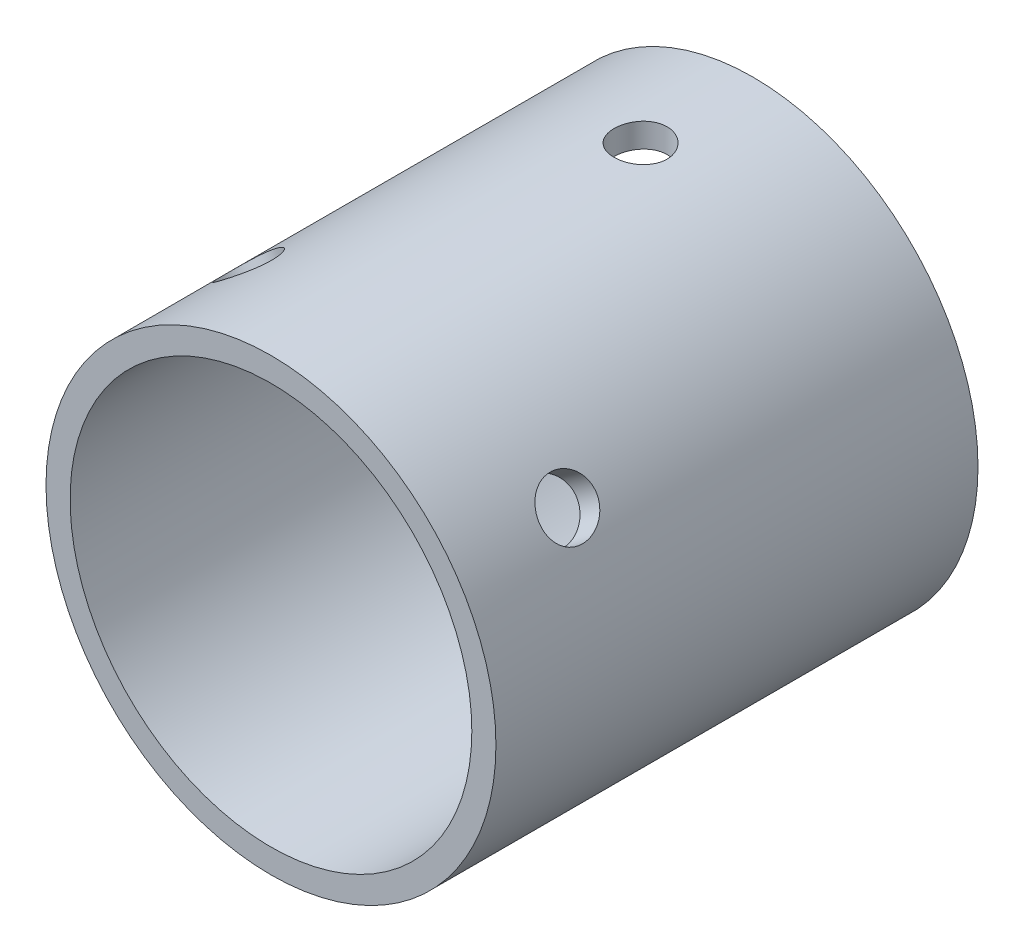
ISO-10303-21;
HEADER;
FILE_DESCRIPTION(('STEP AP214'),'2;1');
FILE_NAME('part.step','',(''),(''),'','','');
FILE_SCHEMA(('AUTOMOTIVE_DESIGN { 1 0 10303 214 1 1 1 1 }'));
ENDSEC;
DATA;
#1=APPLICATION_CONTEXT('core data for automotive mechanical design processes');
#2=APPLICATION_PROTOCOL_DEFINITION('international standard','automotive_design',2000,#1);
#3=PRODUCT_CONTEXT('',#1,'mechanical');
#4=PRODUCT('Part','Part','',(#3));
#5=PRODUCT_RELATED_PRODUCT_CATEGORY('part','',(#4));
#6=PRODUCT_DEFINITION_FORMATION('','',#4);
#7=PRODUCT_DEFINITION_CONTEXT('part definition',#1,'design');
#8=PRODUCT_DEFINITION('design','',#6,#7);
#9=PRODUCT_DEFINITION_SHAPE('','',#8);
#10=(LENGTH_UNIT() NAMED_UNIT(*) SI_UNIT(.MILLI.,.METRE.));
#11=(NAMED_UNIT(*) PLANE_ANGLE_UNIT() SI_UNIT($,.RADIAN.));
#12=(NAMED_UNIT(*) SI_UNIT($,.STERADIAN.) SOLID_ANGLE_UNIT());
#13=UNCERTAINTY_MEASURE_WITH_UNIT(LENGTH_MEASURE(1.E-05),#10,'distance_accuracy_value','');
#14=(GEOMETRIC_REPRESENTATION_CONTEXT(3) GLOBAL_UNCERTAINTY_ASSIGNED_CONTEXT((#13)) GLOBAL_UNIT_ASSIGNED_CONTEXT((#10,
#11,#12)) REPRESENTATION_CONTEXT('',''));
#15=CARTESIAN_POINT('',(0.,0.,0.));
#16=DIRECTION('',(0.,0.,1.));
#17=DIRECTION('',(1.,0.,0.));
#18=AXIS2_PLACEMENT_3D('',#15,#16,#17);
#19=CARTESIAN_POINT('',(0.,0.,30.));
#20=DIRECTION('',(0.,0.,-1.));
#21=DIRECTION('',(-1.,0.,0.));
#22=AXIS2_PLACEMENT_3D('',#19,#20,#21);
#23=CYLINDRICAL_SURFACE('',#22,14.);
#24=CARTESIAN_POINT('',(0.,0.,0.));
#25=DIRECTION('',(0.,0.,1.));
#26=DIRECTION('',(1.,0.,0.));
#27=AXIS2_PLACEMENT_3D('',#24,#25,#26);
#28=CIRCLE('',#27,14.);
#29=CARTESIAN_POINT('',(14.,0.,0.));
#30=VERTEX_POINT('',#29);
#31=EDGE_CURVE('E46',#30,#30,#28,.T.);
#32=ORIENTED_EDGE('',*,*,#31,.T.);
#33=EDGE_LOOP('',(#32));
#34=FACE_BOUND('',#33,.T.);
#35=CARTESIAN_POINT('',(0.,0.,30.));
#36=DIRECTION('',(0.,0.,1.));
#37=DIRECTION('',(1.,0.,0.));
#38=AXIS2_PLACEMENT_3D('',#35,#36,#37);
#39=CIRCLE('',#38,14.);
#40=CARTESIAN_POINT('',(14.,0.,30.));
#41=VERTEX_POINT('',#40);
#42=EDGE_CURVE('E10',#41,#41,#39,.T.);
#43=ORIENTED_EDGE('',*,*,#42,.F.);
#44=EDGE_LOOP('',(#43));
#45=FACE_BOUND('',#44,.T.);
#46=CARTESIAN_POINT('',(0.,14.,5.35));
#47=CARTESIAN_POINT('',(-0.0923377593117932,13.9999987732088,5.35000394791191));
#48=CARTESIAN_POINT('',(-0.184734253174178,13.9990768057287,5.35777727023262));
#49=CARTESIAN_POINT('',(-0.366959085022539,13.9954875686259,5.38866552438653));
#50=CARTESIAN_POINT('',(-0.456784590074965,13.9928184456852,5.41179674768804));
#51=CARTESIAN_POINT('',(-0.631202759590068,13.9860357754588,5.47271235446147));
#52=CARTESIAN_POINT('',(-0.715798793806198,13.9819231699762,5.51048718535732));
#53=CARTESIAN_POINT('',(-0.877433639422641,13.9727116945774,5.59959751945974));
#54=CARTESIAN_POINT('',(-0.954473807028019,13.9676130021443,5.6509305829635));
#55=CARTESIAN_POINT('',(-1.09920581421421,13.9569711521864,5.76597046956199));
#56=CARTESIAN_POINT('',(-1.16685515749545,13.9514261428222,5.82973059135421));
#57=CARTESIAN_POINT('',(-1.29051941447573,13.9405316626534,5.9677004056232));
#58=CARTESIAN_POINT('',(-1.34653375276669,13.9351822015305,6.04191061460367));
#59=CARTESIAN_POINT('',(-1.44549410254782,13.9252661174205,6.19894739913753));
#60=CARTESIAN_POINT('',(-1.48840067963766,13.9207018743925,6.28179898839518));
#61=CARTESIAN_POINT('',(-1.55967573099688,13.9128970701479,6.45359427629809));
#62=CARTESIAN_POINT('',(-1.58804469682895,13.9096564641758,6.54253776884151));
#63=CARTESIAN_POINT('',(-1.62931096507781,13.9048833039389,6.72355301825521));
#64=CARTESIAN_POINT('',(-1.64227968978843,13.9033428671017,6.81560828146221));
#65=CARTESIAN_POINT('',(-1.65259827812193,13.902120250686,7.00060059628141));
#66=CARTESIAN_POINT('',(-1.64994870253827,13.9024380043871,7.09353761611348));
#67=CARTESIAN_POINT('',(-1.62916460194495,13.9048886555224,7.27715922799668));
#68=CARTESIAN_POINT('',(-1.61110853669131,13.9070123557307,7.36785284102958));
#69=CARTESIAN_POINT('',(-1.56014631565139,13.9128212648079,7.54491364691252));
#70=CARTESIAN_POINT('',(-1.52723988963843,13.9165065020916,7.63128076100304));
#71=CARTESIAN_POINT('',(-1.44742600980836,13.9250337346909,7.79748193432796));
#72=CARTESIAN_POINT('',(-1.40048424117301,13.9298785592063,7.87729936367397));
#73=CARTESIAN_POINT('',(-1.293956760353,13.9401768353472,8.02795329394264));
#74=CARTESIAN_POINT('',(-1.23437053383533,13.9456303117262,8.09878942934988));
#75=CARTESIAN_POINT('',(-1.10380969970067,13.9565723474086,8.22992556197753));
#76=CARTESIAN_POINT('',(-1.0327674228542,13.9620609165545,8.29015820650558));
#77=CARTESIAN_POINT('',(-0.881544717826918,13.9724233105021,8.39785388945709));
#78=CARTESIAN_POINT('',(-0.801364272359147,13.9772971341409,8.44531690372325));
#79=CARTESIAN_POINT('',(-0.634090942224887,13.9858834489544,8.52612522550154));
#80=CARTESIAN_POINT('',(-0.546996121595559,13.989595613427,8.55946656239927));
#81=CARTESIAN_POINT('',(-0.368390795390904,13.995437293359,8.61103289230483));
#82=CARTESIAN_POINT('',(-0.276880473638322,13.9975668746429,8.62925851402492));
#83=CARTESIAN_POINT('',(-0.0926244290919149,13.9999949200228,8.64998933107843));
#84=CARTESIAN_POINT('',(0.000110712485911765,14.0003041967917,8.65258735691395));
#85=CARTESIAN_POINT('',(0.184695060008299,13.9990859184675,8.6422338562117));
#86=CARTESIAN_POINT('',(0.276544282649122,13.9975583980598,8.62928262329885));
#87=CARTESIAN_POINT('',(0.45647745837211,13.9928449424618,8.58827533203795));
#88=CARTESIAN_POINT('',(0.544571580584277,13.9896638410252,8.56026329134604));
#89=CARTESIAN_POINT('',(0.714811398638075,13.9819995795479,8.48997514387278));
#90=CARTESIAN_POINT('',(0.79695691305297,13.9775163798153,8.44769860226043));
#91=CARTESIAN_POINT('',(0.953383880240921,13.9677212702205,8.34985520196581));
#92=CARTESIAN_POINT('',(1.02762735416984,13.962405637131,8.29422800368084));
#93=CARTESIAN_POINT('',(1.16575694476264,13.9515526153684,8.17134805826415));
#94=CARTESIAN_POINT('',(1.22964269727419,13.9460152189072,8.10409490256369));
#95=CARTESIAN_POINT('',(1.3455705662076,13.935309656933,7.95946436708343));
#96=CARTESIAN_POINT('',(1.39755133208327,13.9301434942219,7.88203764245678));
#97=CARTESIAN_POINT('',(1.48777049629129,13.9207975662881,7.71949847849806));
#98=CARTESIAN_POINT('',(1.52600914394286,13.9166177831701,7.63438617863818));
#99=CARTESIAN_POINT('',(1.58755824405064,13.909731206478,7.45909366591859));
#100=CARTESIAN_POINT('',(1.61090387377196,13.9070209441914,7.36892594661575));
#101=CARTESIAN_POINT('',(1.64211780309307,13.9033700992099,7.18591634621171));
#102=CARTESIAN_POINT('',(1.64998673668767,13.9024294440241,7.09307457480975));
#103=CARTESIAN_POINT('',(1.6500131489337,13.9024262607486,6.90796245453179));
#104=CARTESIAN_POINT('',(1.64226700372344,13.9033522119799,6.81569210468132));
#105=CARTESIAN_POINT('',(1.61148661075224,13.9069532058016,6.63377413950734));
#106=CARTESIAN_POINT('',(1.58845235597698,13.9096282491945,6.54412652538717));
#107=CARTESIAN_POINT('',(1.52777867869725,13.9164225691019,6.37000785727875));
#108=CARTESIAN_POINT('',(1.49014335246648,13.9205414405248,6.28553535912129));
#109=CARTESIAN_POINT('',(1.4013454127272,13.9297600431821,6.12408961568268));
#110=CARTESIAN_POINT('',(1.35018270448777,13.9348597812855,6.04711642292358));
#111=CARTESIAN_POINT('',(1.23542317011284,13.9455032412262,5.90236106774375));
#112=CARTESIAN_POINT('',(1.17175446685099,13.9510494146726,5.83463606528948));
#113=CARTESIAN_POINT('',(1.03393869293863,13.9619389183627,5.71079316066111));
#114=CARTESIAN_POINT('',(0.959789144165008,13.9672822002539,5.6546780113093));
#115=CARTESIAN_POINT('',(0.8028308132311,13.9771836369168,5.55548848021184));
#116=CARTESIAN_POINT('',(0.719993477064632,13.9817390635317,5.51245903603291));
#117=CARTESIAN_POINT('',(0.548263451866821,13.9895234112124,5.44098152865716));
#118=CARTESIAN_POINT('',(0.459377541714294,13.9927537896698,5.41251743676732));
#119=CARTESIAN_POINT('',(0.30834826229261,13.9967351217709,5.37788015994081));
#120=CARTESIAN_POINT('',(0.247161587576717,13.9979535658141,5.36743989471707));
#121=CARTESIAN_POINT('',(0.123992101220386,13.999586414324,5.35349851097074));
#122=CARTESIAN_POINT('',(0.0620092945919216,14.0000008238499,5.34999734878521));
#123=CARTESIAN_POINT('',(0.,14.,5.35));
#124=B_SPLINE_CURVE_WITH_KNOTS('',3,(#46,#47,#48,#49,#50,#51,#52,#53,#54,#55,#56,#57,#58,#59,
#60,#61,#62,#63,#64,#65,#66,#67,#68,#69,#70,#71,#72,#73,#74,#75,#76,#77,#78,#79,#80,#81,#82,#83,
#84,#85,#86,#87,#88,#89,#90,#91,#92,#93,#94,#95,#96,#97,#98,#99,#100,#101,#102,#103,#104,#105,
#106,#107,#108,#109,#110,#111,#112,#113,#114,#115,#116,#117,#118,#119,#120,#121,#122,#123),
.UNSPECIFIED.,.T.,.F.,(4,2,2,2,2,2,2,2,2,2,2,2,2,2,2,2,2,2,2,2,2,2,2,2,2,2,2,2,2,2,2,2,2,2,2,2,
2,2,4),(0.,0.276786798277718,0.55386767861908,0.830768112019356,1.10761875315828,
1.38568400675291,1.66376300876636,1.94267054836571,2.22156865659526,2.49916819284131,
2.77675776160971,3.05294204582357,3.32913135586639,3.60600151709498,3.88288294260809,
4.16146418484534,4.44004595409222,4.71870600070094,4.99735445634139,5.2743460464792,
5.55133240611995,5.82751359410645,6.10370320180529,6.38116539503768,6.65863734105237,
6.93750854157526,7.21637468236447,7.4945796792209,7.77277327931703,8.04925512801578,
8.32573710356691,8.60214156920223,8.87854797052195,9.15659210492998,9.43470209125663,
9.71375662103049,9.99250339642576,10.1783803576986,10.3642561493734),.UNSPECIFIED.);
#125=CARTESIAN_POINT('',(0.,14.,5.35));
#126=VERTEX_POINT('',#125);
#127=EDGE_CURVE('E62',#126,#126,#124,.T.);
#128=ORIENTED_EDGE('',*,*,#127,.F.);
#129=EDGE_LOOP('',(#128));
#130=FACE_BOUND('',#129,.T.);
#131=CARTESIAN_POINT('',(12.3819398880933,6.5335721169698,23.));
#132=CARTESIAN_POINT('',(12.3819386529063,6.53357633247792,22.9021146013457));
#133=CARTESIAN_POINT('',(12.3780700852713,6.54092220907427,22.8041680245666));
#134=CARTESIAN_POINT('',(12.3626278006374,6.57006052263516,22.6110007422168));
#135=CARTESIAN_POINT('',(12.3510460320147,6.59186805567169,22.5157829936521));
#136=CARTESIAN_POINT('',(12.3203136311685,6.64912935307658,22.3308980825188));
#137=CARTESIAN_POINT('',(12.301168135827,6.68457385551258,22.2412272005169));
#138=CARTESIAN_POINT('',(12.2555427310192,6.76785906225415,22.0698900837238));
#139=CARTESIAN_POINT('',(12.2290640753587,6.8156976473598,21.9882224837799));
#140=CARTESIAN_POINT('',(12.1689695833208,6.9224228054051,21.8347364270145));
#141=CARTESIAN_POINT('',(12.1353187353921,6.9813634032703,21.7629692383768));
#142=CARTESIAN_POINT('',(12.0614665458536,7.10819237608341,21.6317640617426));
#143=CARTESIAN_POINT('',(12.0212648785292,7.17608119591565,21.5723266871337));
#144=CARTESIAN_POINT('',(11.9348719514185,7.31886648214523,21.4672844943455));
#145=CARTESIAN_POINT('',(11.8886613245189,7.39378537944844,21.4217260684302));
#146=CARTESIAN_POINT('',(11.7913045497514,7.54807582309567,21.3460321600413));
#147=CARTESIAN_POINT('',(11.7401585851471,7.62744720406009,21.3158961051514));
#148=CARTESIAN_POINT('',(11.6344198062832,7.78777531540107,21.2720555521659));
#149=CARTESIAN_POINT('',(11.5798464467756,7.86872156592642,21.2582658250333));
#150=CARTESIAN_POINT('',(11.4684594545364,8.03019648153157,21.2472452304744));
#151=CARTESIAN_POINT('',(11.411645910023,8.11072516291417,21.2500137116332));
#152=CARTESIAN_POINT('',(11.2977545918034,8.26862552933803,21.2719626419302));
#153=CARTESIAN_POINT('',(11.2406800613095,8.34601232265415,21.291051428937));
#154=CARTESIAN_POINT('',(11.1277247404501,8.49603228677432,21.344955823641));
#155=CARTESIAN_POINT('',(11.0718439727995,8.56866536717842,21.3797717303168));
#156=CARTESIAN_POINT('',(10.9629667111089,8.70753555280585,21.4642395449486));
#157=CARTESIAN_POINT('',(10.909978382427,8.77375492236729,21.5139311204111));
#158=CARTESIAN_POINT('',(10.8088812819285,8.89800602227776,21.6267108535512));
#159=CARTESIAN_POINT('',(10.7607727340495,8.95603737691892,21.689799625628));
#160=CARTESIAN_POINT('',(10.6708704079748,9.06297126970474,21.8280962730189));
#161=CARTESIAN_POINT('',(10.6291220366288,9.11180870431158,21.9033840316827));
#162=CARTESIAN_POINT('',(10.5539401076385,9.19878599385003,22.0636670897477));
#163=CARTESIAN_POINT('',(10.5205065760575,9.23692581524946,22.1486624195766));
#164=CARTESIAN_POINT('',(10.4632838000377,9.30169715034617,22.3260186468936));
#165=CARTESIAN_POINT('',(10.439498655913,9.32832377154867,22.4183826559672));
#166=CARTESIAN_POINT('',(10.402589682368,9.36946630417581,22.6078176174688));
#167=CARTESIAN_POINT('',(10.3894653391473,9.3839827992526,22.7048883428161));
#168=CARTESIAN_POINT('',(10.3744921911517,9.40053390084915,22.9002802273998));
#169=CARTESIAN_POINT('',(10.3725679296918,9.40265203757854,22.9985885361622));
#170=CARTESIAN_POINT('',(10.3798755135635,9.3945842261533,23.1942793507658));
#171=CARTESIAN_POINT('',(10.3891071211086,9.38439854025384,23.2916618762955));
#172=CARTESIAN_POINT('',(10.4182813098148,9.35199883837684,23.4824020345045));
#173=CARTESIAN_POINT('',(10.4381876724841,9.32982549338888,23.5757721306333));
#174=CARTESIAN_POINT('',(10.487862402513,9.27394907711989,23.7562269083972));
#175=CARTESIAN_POINT('',(10.5176311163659,9.24024560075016,23.8433113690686));
#176=CARTESIAN_POINT('',(10.5860213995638,9.16181543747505,24.0092282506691));
#177=CARTESIAN_POINT('',(10.6246888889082,9.11703147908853,24.0880146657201));
#178=CARTESIAN_POINT('',(10.7092940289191,9.01749837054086,24.2346295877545));
#179=CARTESIAN_POINT('',(10.7552319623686,8.96274883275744,24.3024576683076));
#180=CARTESIAN_POINT('',(10.8529588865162,8.84416241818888,24.4256229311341));
#181=CARTESIAN_POINT('',(10.9047797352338,8.7802755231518,24.4808867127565));
#182=CARTESIAN_POINT('',(11.0122036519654,8.64516103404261,24.5768467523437));
#183=CARTESIAN_POINT('',(11.0678066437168,8.57393358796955,24.6175433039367));
#184=CARTESIAN_POINT('',(11.1807431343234,8.42612620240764,24.6830924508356));
#185=CARTESIAN_POINT('',(11.2380715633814,8.34956121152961,24.7079874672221));
#186=CARTESIAN_POINT('',(11.3527512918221,8.19295137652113,24.7413648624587));
#187=CARTESIAN_POINT('',(11.4101025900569,8.11290668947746,24.7498479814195));
#188=CARTESIAN_POINT('',(11.5227149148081,7.95214487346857,24.7501469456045));
#189=CARTESIAN_POINT('',(11.5779875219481,7.87143604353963,24.7420759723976));
#190=CARTESIAN_POINT('',(11.6853488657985,7.71115617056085,24.7097355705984));
#191=CARTESIAN_POINT('',(11.7374376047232,7.63158512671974,24.6854661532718));
#192=CARTESIAN_POINT('',(11.8371472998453,7.47599398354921,24.6214533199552));
#193=CARTESIAN_POINT('',(11.8847698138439,7.39997265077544,24.5817153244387));
#194=CARTESIAN_POINT('',(11.9745580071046,7.25378031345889,24.4879050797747));
#195=CARTESIAN_POINT('',(12.0167236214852,7.18360937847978,24.4338326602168));
#196=CARTESIAN_POINT('',(12.095083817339,7.05088191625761,24.3124697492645));
#197=CARTESIAN_POINT('',(12.1312375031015,6.98837824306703,24.2450950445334));
#198=CARTESIAN_POINT('',(12.1966673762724,6.87354962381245,24.0992149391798));
#199=CARTESIAN_POINT('',(12.2259419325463,6.82122709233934,24.0207069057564));
#200=CARTESIAN_POINT('',(12.2772942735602,6.72836388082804,23.8544410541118));
#201=CARTESIAN_POINT('',(12.2993438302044,6.68786947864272,23.7666486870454));
#202=CARTESIAN_POINT('',(12.3357947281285,6.62039668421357,23.5846002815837));
#203=CARTESIAN_POINT('',(12.3502043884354,6.59340359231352,23.4903514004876));
#204=CARTESIAN_POINT('',(12.3677826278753,6.56034810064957,23.3296790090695));
#205=CARTESIAN_POINT('',(12.3730880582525,6.55032441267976,23.2642689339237));
#206=CARTESIAN_POINT('',(12.3801670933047,6.53693501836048,23.1325819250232));
#207=CARTESIAN_POINT('',(12.3819407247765,6.53356926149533,23.0663049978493));
#208=CARTESIAN_POINT('',(12.3819398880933,6.5335721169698,23.));
#209=B_SPLINE_CURVE_WITH_KNOTS('',3,(#131,#132,#133,#134,#135,#136,#137,#138,#139,#140,#141,
#142,#143,#144,#145,#146,#147,#148,#149,#150,#151,#152,#153,#154,#155,#156,#157,#158,#159,#160,
#161,#162,#163,#164,#165,#166,#167,#168,#169,#170,#171,#172,#173,#174,#175,#176,#177,#178,#179,
#180,#181,#182,#183,#184,#185,#186,#187,#188,#189,#190,#191,#192,#193,#194,#195,#196,#197,#198,
#199,#200,#201,#202,#203,#204,#205,#206,#207,#208),.UNSPECIFIED.,.T.,.F.,(4,2,2,2,2,2,2,2,2,2,2,
2,2,2,2,2,2,2,2,2,2,2,2,2,2,2,2,2,2,2,2,2,2,2,2,2,2,2,4),(0.,0.293413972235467,
0.587134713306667,0.880656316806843,1.17412776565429,1.46906604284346,1.76401898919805,
2.05994730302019,2.35586463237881,2.6502321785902,2.94458814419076,3.23730165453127,
3.53002072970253,3.82352743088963,4.11704759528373,4.41257388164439,4.70810109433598,
5.00375376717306,5.29939219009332,5.59303652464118,5.88667460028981,6.17932263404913,
6.47198095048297,6.76618473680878,7.06039996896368,7.3562922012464,7.65217846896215,
7.94726699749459,8.24234221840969,8.53540671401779,8.82847100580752,9.12143269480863,
9.41439786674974,9.70928090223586,10.0042337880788,10.3003256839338,10.5960945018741,
10.7948469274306,10.9935978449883),.UNSPECIFIED.);
#210=CARTESIAN_POINT('',(12.3819398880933,6.5335721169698,23.));
#211=VERTEX_POINT('',#210);
#212=EDGE_CURVE('E63',#211,#211,#209,.T.);
#213=ORIENTED_EDGE('',*,*,#212,.F.);
#214=EDGE_LOOP('',(#213));
#215=FACE_BOUND('',#214,.T.);
#216=CARTESIAN_POINT('',(-6.96171551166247,12.1463787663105,23.));
#217=CARTESIAN_POINT('',(-6.96171968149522,12.1463773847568,22.9021146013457));
#218=CARTESIAN_POINT('',(-6.9689260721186,12.1422548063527,22.8041680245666));
#219=CARTESIAN_POINT('',(-6.99750770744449,12.1258050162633,22.6110007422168));
#220=CARTESIAN_POINT('',(-7.01889775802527,12.1134692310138,22.5157829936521));
#221=CARTESIAN_POINT('',(-7.07505162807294,12.0807571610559,22.3308980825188));
#222=CARTESIAN_POINT('',(-7.10980637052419,12.060386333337,22.2412272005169));
#223=CARTESIAN_POINT('',(-7.19144853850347,12.011882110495,22.0698900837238));
#224=CARTESIAN_POINT('',(-7.23833388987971,11.9837500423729,21.9882224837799));
#225=CARTESIAN_POINT('',(-7.34289676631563,11.9199675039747,21.8347364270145));
#226=CARTESIAN_POINT('',(-7.40062706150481,11.8842801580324,21.7629692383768));
#227=CARTESIAN_POINT('',(-7.52480136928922,11.8060466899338,21.6317640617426));
#228=CARTESIAN_POINT('',(-7.59124581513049,11.7635002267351,21.5723266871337));
#229=CARTESIAN_POINT('',(-7.7309290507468,11.6721767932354,21.4672844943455));
#230=CARTESIAN_POINT('',(-7.80418958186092,11.6233796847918,21.4217260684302));
#231=CARTESIAN_POINT('',(-7.9549883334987,11.5206975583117,21.3460321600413));
#232=CARTESIAN_POINT('',(-8.03252639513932,11.4668127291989,21.3158961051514));
#233=CARTESIAN_POINT('',(-8.18906660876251,11.355542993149,21.2720555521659));
#234=CARTESIAN_POINT('',(-8.26805896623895,11.2981778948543,21.2582658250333));
#235=CARTESIAN_POINT('',(-8.42554816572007,11.1812233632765,21.2472452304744));
#236=CARTESIAN_POINT('',(-8.50404502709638,11.121634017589,21.2500137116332));
#237=CARTESIAN_POINT('',(-8.65787445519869,11.0023014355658,21.2719626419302));
#238=CARTESIAN_POINT('',(-8.73322223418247,10.9425609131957,21.291051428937));
#239=CARTESIAN_POINT('',(-8.87920872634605,10.8244387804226,21.344955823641));
#240=CARTESIAN_POINT('',(-8.94984734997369,10.7660571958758,21.3797717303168));
#241=CARTESIAN_POINT('',(-9.08483317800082,10.6523997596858,21.4642395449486));
#242=CARTESIAN_POINT('',(-9.14916294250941,10.5971326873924,21.5139311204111));
#243=CARTESIAN_POINT('',(-9.26981011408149,10.4917608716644,21.6267108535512));
#244=CARTESIAN_POINT('',(-9.3261271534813,10.441656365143,21.689799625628));
#245=CARTESIAN_POINT('',(-9.42985835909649,10.3480768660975,21.8280962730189));
#246=CARTESIAN_POINT('',(-9.47720904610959,10.3046495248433,21.9033840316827));
#247=CARTESIAN_POINT('',(-9.56150953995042,10.2264779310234,22.0636670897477));
#248=CARTESIAN_POINT('',(-9.59845931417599,10.1917337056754,22.1486624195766));
#249=CARTESIAN_POINT('',(-9.66119414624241,10.132285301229,22.3260186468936));
#250=CARTESIAN_POINT('',(-9.68697445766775,10.1075853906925,22.4183826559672));
#251=CARTESIAN_POINT('',(-9.72680382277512,10.0692630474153,22.6078176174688));
#252=CARTESIAN_POINT('',(-9.74085344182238,10.0556400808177,22.7048883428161));
#253=CARTESIAN_POINT('',(-9.75687190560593,10.0400984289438,22.9002802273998));
#254=CARTESIAN_POINT('',(-9.75892159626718,10.0381014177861,22.9985885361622));
#255=CARTESIAN_POINT('',(-9.75111373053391,10.0456861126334,23.1942793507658));
#256=CARTESIAN_POINT('',(-9.74125642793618,10.0552675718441,23.2916618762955));
#257=CARTESIAN_POINT('',(-9.7098946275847,10.0855547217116,23.4824020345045));
#258=CARTESIAN_POINT('',(-9.68842951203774,10.1062227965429,23.5757721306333));
#259=CARTESIAN_POINT('',(-9.63432075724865,10.1578173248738,23.7562269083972));
#260=CARTESIAN_POINT('',(-9.60167672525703,10.188744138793,23.8433113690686));
#261=CARTESIAN_POINT('',(-9.52568112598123,10.2598299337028,24.0092282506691));
#262=CARTESIAN_POINT('',(-9.482273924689,10.3000368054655,24.0880146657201));
#263=CARTESIAN_POINT('',(-9.38575412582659,10.3880640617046,24.2346295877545));
#264=CARTESIAN_POINT('',(-9.33264115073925,10.4358847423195,24.3024576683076));
#265=CARTESIAN_POINT('',(-9.21753759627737,10.5376907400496,24.4256229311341));
#266=CARTESIAN_POINT('',(-9.15549814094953,10.591709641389,24.4808867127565));
#267=CARTESIAN_POINT('',(-9.02421500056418,10.7037835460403,24.5768467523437));
#268=CARTESIAN_POINT('',(-8.95497146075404,10.7618384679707,24.6175433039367));
#269=CARTESIAN_POINT('',(-8.81119554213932,10.8798645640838,24.6830924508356));
#270=CARTESIAN_POINT('',(-8.73667792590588,10.9398301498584,24.7079874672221));
#271=CARTESIAN_POINT('',(-8.58416575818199,11.0599056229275,24.7413648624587));
#272=CARTESIAN_POINT('',(-8.50617136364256,11.1200155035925,24.7498479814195));
#273=CARTESIAN_POINT('',(-8.34943759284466,11.2381697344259,24.7501469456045));
#274=CARTESIAN_POINT('',(-8.27070691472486,11.296225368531,24.7420759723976));
#275=CARTESIAN_POINT('',(-8.11427153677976,11.40911499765,24.7097355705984));
#276=CARTESIAN_POINT('',(-8.03656683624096,11.4639489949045,24.6854661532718));
#277=CARTESIAN_POINT('',(-7.88455029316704,11.5690280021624,24.6214533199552));
#278=CARTESIAN_POINT('',(-7.81023727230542,11.6192746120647,24.5817153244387));
#279=CARTESIAN_POINT('',(-7.66726755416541,11.7141101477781,24.4879050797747));
#280=CARTESIAN_POINT('',(-7.59861092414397,11.7586990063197,24.4338326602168));
#281=CARTESIAN_POINT('',(-7.46869904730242,11.8416435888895,24.3124697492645));
#282=CARTESIAN_POINT('',(-7.40749519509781,11.8799565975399,24.2450950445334));
#283=CARTESIAN_POINT('',(-7.29501999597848,11.9493540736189,24.0992149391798));
#284=CARTESIAN_POINT('',(-7.24375100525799,11.9804368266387,24.0207069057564));
#285=CARTESIAN_POINT('',(-7.15273653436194,12.0349987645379,23.8544410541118));
#286=CARTESIAN_POINT('',(-7.1130363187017,12.0584481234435,23.7666486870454));
#287=CARTESIAN_POINT('',(-7.04687674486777,12.0972315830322,23.5846002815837));
#288=CARTESIAN_POINT('',(-7.02040298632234,12.1125745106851,23.4903514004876));
#289=CARTESIAN_POINT('',(-6.98798110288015,12.1312956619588,23.3296790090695));
#290=CARTESIAN_POINT('',(-6.97814867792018,12.1369476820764,23.2642689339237));
#291=CARTESIAN_POINT('',(-6.96501449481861,12.1444896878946,23.1325819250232));
#292=CARTESIAN_POINT('',(-6.9617126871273,12.1463797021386,23.0663049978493));
#293=CARTESIAN_POINT('',(-6.96171551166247,12.1463787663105,23.));
#294=B_SPLINE_CURVE_WITH_KNOTS('',3,(#216,#217,#218,#219,#220,#221,#222,#223,#224,#225,#226,
#227,#228,#229,#230,#231,#232,#233,#234,#235,#236,#237,#238,#239,#240,#241,#242,#243,#244,#245,
#246,#247,#248,#249,#250,#251,#252,#253,#254,#255,#256,#257,#258,#259,#260,#261,#262,#263,#264,
#265,#266,#267,#268,#269,#270,#271,#272,#273,#274,#275,#276,#277,#278,#279,#280,#281,#282,#283,
#284,#285,#286,#287,#288,#289,#290,#291,#292,#293),.UNSPECIFIED.,.T.,.F.,(4,2,2,2,2,2,2,2,2,2,2,
2,2,2,2,2,2,2,2,2,2,2,2,2,2,2,2,2,2,2,2,2,2,2,2,2,2,2,4),(0.,0.293413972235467,
0.587134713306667,0.880656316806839,1.17412776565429,1.46906604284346,1.76401898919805,
2.05994730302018,2.35586463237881,2.6502321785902,2.94458814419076,3.23730165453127,
3.53002072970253,3.82352743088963,4.11704759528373,4.41257388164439,4.70810109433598,
5.00375376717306,5.29939219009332,5.59303652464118,5.88667460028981,6.17932263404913,
6.47198095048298,6.76618473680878,7.06039996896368,7.3562922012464,7.65217846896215,
7.94726699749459,8.24234221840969,8.53540671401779,8.82847100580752,9.12143269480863,
9.41439786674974,9.70928090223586,10.0042337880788,10.3003256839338,10.5960945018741,
10.7948469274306,10.9935978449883),.UNSPECIFIED.);
#295=CARTESIAN_POINT('',(-6.96171551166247,12.1463787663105,23.));
#296=VERTEX_POINT('',#295);
#297=EDGE_CURVE('E103',#296,#296,#294,.T.);
#298=ORIENTED_EDGE('',*,*,#297,.F.);
#299=EDGE_LOOP('',(#298));
#300=FACE_BOUND('',#299,.T.);
#301=ADVANCED_FACE('F34',(#34,#45,#130,#215,#300),#23,.T.);
#302=CARTESIAN_POINT('',(0.,0.,30.));
#303=DIRECTION('',(0.,0.,-1.));
#304=DIRECTION('',(-1.,0.,0.));
#305=AXIS2_PLACEMENT_3D('',#302,#303,#304);
#306=CYLINDRICAL_SURFACE('',#305,12.5);
#307=CARTESIAN_POINT('',(11.1423166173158,5.66557855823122,23.));
#308=CARTESIAN_POINT('',(11.1423155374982,5.66558279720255,22.9022199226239));
#309=CARTESIAN_POINT('',(11.1385596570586,5.67298606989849,22.8043812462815));
#310=CARTESIAN_POINT('',(11.1235583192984,5.70234264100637,22.6114340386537));
#311=CARTESIAN_POINT('',(11.1123053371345,5.72431055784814,22.5163283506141));
#312=CARTESIAN_POINT('',(11.0824151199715,5.78196528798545,22.3316682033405));
#313=CARTESIAN_POINT('',(11.0637832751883,5.81764208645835,22.2421097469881));
#314=CARTESIAN_POINT('',(11.0193185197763,5.90142848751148,22.0709756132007));
#315=CARTESIAN_POINT('',(10.993486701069,5.94953620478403,21.9893987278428));
#316=CARTESIAN_POINT('',(10.9347198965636,6.05686856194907,21.835958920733));
#317=CARTESIAN_POINT('',(10.9017415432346,6.11616077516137,21.7641598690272));
#318=CARTESIAN_POINT('',(10.8292104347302,6.24368251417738,21.6328665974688));
#319=CARTESIAN_POINT('',(10.7896573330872,6.31191251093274,21.5733730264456));
#320=CARTESIAN_POINT('',(10.7044289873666,6.45539939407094,21.4681464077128));
#321=CARTESIAN_POINT('',(10.6587288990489,6.5306843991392,21.4224717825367));
#322=CARTESIAN_POINT('',(10.5622243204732,6.68563674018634,21.3465541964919));
#323=CARTESIAN_POINT('',(10.5114200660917,6.76530387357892,21.3163105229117));
#324=CARTESIAN_POINT('',(10.4062253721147,6.92601124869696,21.272305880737));
#325=CARTESIAN_POINT('',(10.3518606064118,7.00703907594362,21.2584382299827));
#326=CARTESIAN_POINT('',(10.2406786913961,7.16854998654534,21.2472482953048));
#327=CARTESIAN_POINT('',(10.1838616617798,7.24903309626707,21.2499252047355));
#328=CARTESIAN_POINT('',(10.0698403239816,7.40659914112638,21.2716636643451));
#329=CARTESIAN_POINT('',(10.0126415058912,7.48370192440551,21.2906104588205));
#330=CARTESIAN_POINT('',(9.8992557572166,7.63305524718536,21.3441710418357));
#331=CARTESIAN_POINT('',(9.84306884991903,7.70530567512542,21.3787851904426));
#332=CARTESIAN_POINT('',(9.73339366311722,7.84339573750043,21.4628173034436));
#333=CARTESIAN_POINT('',(9.6799149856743,7.90921323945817,21.5122841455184));
#334=CARTESIAN_POINT('',(9.57773513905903,8.03264711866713,21.6245818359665));
#335=CARTESIAN_POINT('',(9.529034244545,8.09026302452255,21.6874134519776));
#336=CARTESIAN_POINT('',(9.43781538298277,8.19649895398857,21.8252978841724));
#337=CARTESIAN_POINT('',(9.39535397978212,8.24503765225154,21.9004508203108));
#338=CARTESIAN_POINT('',(9.31878881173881,8.33147765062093,22.0605028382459));
#339=CARTESIAN_POINT('',(9.2846850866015,8.36937890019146,22.1454019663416));
#340=CARTESIAN_POINT('',(9.22622835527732,8.43377805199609,22.3226333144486));
#341=CARTESIAN_POINT('',(9.20188137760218,8.46026890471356,22.41497008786));
#342=CARTESIAN_POINT('',(9.16402711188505,8.50125830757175,22.6044038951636));
#343=CARTESIAN_POINT('',(9.15051916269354,8.51575758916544,22.7015006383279));
#344=CARTESIAN_POINT('',(9.13501290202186,8.53238943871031,22.8968195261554));
#345=CARTESIAN_POINT('',(9.13291828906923,8.53462548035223,22.9950252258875));
#346=CARTESIAN_POINT('',(9.14007328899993,8.52696233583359,23.190543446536));
#347=CARTESIAN_POINT('',(9.14932259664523,8.51706347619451,23.2878559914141));
#348=CARTESIAN_POINT('',(9.17868922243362,8.48540642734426,23.4783978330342));
#349=CARTESIAN_POINT('',(9.19875957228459,8.46369948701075,23.5716429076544));
#350=CARTESIAN_POINT('',(9.24887603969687,8.40890376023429,23.7518988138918));
#351=CARTESIAN_POINT('',(9.27892259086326,8.37581447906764,23.8389093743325));
#352=CARTESIAN_POINT('',(9.34798238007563,8.29866935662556,24.004856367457));
#353=CARTESIAN_POINT('',(9.38705337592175,8.25454271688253,24.0837358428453));
#354=CARTESIAN_POINT('',(9.47250071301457,8.15634450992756,24.2305978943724));
#355=CARTESIAN_POINT('',(9.51887741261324,8.1022724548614,24.2985799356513));
#356=CARTESIAN_POINT('',(9.61754019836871,7.98491254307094,24.4222155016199));
#357=CARTESIAN_POINT('',(9.66986649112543,7.92156103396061,24.4777765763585));
#358=CARTESIAN_POINT('',(9.77824024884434,7.78739005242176,24.5743507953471));
#359=CARTESIAN_POINT('',(9.83428762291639,7.71657076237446,24.6153642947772));
#360=CARTESIAN_POINT('',(9.94796433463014,7.56945251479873,24.6815293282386));
#361=CARTESIAN_POINT('',(10.0055878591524,7.49317235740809,24.706732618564));
#362=CARTESIAN_POINT('',(10.1207032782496,7.33694581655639,24.7407296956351));
#363=CARTESIAN_POINT('',(10.1781951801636,7.25699964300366,24.7495244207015));
#364=CARTESIAN_POINT('',(10.2908132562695,7.09638651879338,24.7504340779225));
#365=CARTESIAN_POINT('',(10.3459554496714,7.01573156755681,24.7426909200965));
#366=CARTESIAN_POINT('',(10.4528954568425,6.85538233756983,24.7110472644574));
#367=CARTESIAN_POINT('',(10.5046932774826,6.77568805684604,24.6871467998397));
#368=CARTESIAN_POINT('',(10.6036809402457,6.61970435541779,24.6239149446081));
#369=CARTESIAN_POINT('',(10.6508733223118,6.54341307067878,24.5845921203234));
#370=CARTESIAN_POINT('',(10.7397254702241,6.39653605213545,24.4916466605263));
#371=CARTESIAN_POINT('',(10.7813851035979,6.32595045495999,24.4380236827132));
#372=CARTESIAN_POINT('',(10.8587824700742,6.19216233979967,24.3174817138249));
#373=CARTESIAN_POINT('',(10.8944689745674,6.12902493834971,24.2504575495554));
#374=CARTESIAN_POINT('',(10.9590023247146,6.0128773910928,24.1052365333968));
#375=CARTESIAN_POINT('',(10.9878475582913,5.9598696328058,24.0270370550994));
#376=CARTESIAN_POINT('',(11.0384690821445,5.86558492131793,23.8612421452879));
#377=CARTESIAN_POINT('',(11.0602103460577,5.82436621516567,23.7736029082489));
#378=CARTESIAN_POINT('',(11.0961898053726,5.75552723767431,23.5917661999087));
#379=CARTESIAN_POINT('',(11.1104359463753,5.72789256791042,23.4975757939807));
#380=CARTESIAN_POINT('',(11.1280158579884,5.69363642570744,23.3357784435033));
#381=CARTESIAN_POINT('',(11.1333755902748,5.68313387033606,23.269180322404));
#382=CARTESIAN_POINT('',(11.1405263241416,5.66910350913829,23.1350641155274));
#383=CARTESIAN_POINT('',(11.1423173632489,5.66557562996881,23.0675460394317));
#384=CARTESIAN_POINT('',(11.1423166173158,5.66557855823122,23.));
#385=B_SPLINE_CURVE_WITH_KNOTS('',3,(#307,#308,#309,#310,#311,#312,#313,#314,#315,#316,#317,
#318,#319,#320,#321,#322,#323,#324,#325,#326,#327,#328,#329,#330,#331,#332,#333,#334,#335,#336,
#337,#338,#339,#340,#341,#342,#343,#344,#345,#346,#347,#348,#349,#350,#351,#352,#353,#354,#355,
#356,#357,#358,#359,#360,#361,#362,#363,#364,#365,#366,#367,#368,#369,#370,#371,#372,#373,#374,
#375,#376,#377,#378,#379,#380,#381,#382,#383,#384),.UNSPECIFIED.,.T.,.F.,(4,2,2,2,2,2,2,2,2,2,2,
2,2,2,2,2,2,2,2,2,2,2,2,2,2,2,2,2,2,2,2,2,2,2,2,2,2,2,4),(0.,0.293093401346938,
0.586481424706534,0.879655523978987,1.17278518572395,1.46774612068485,1.76272260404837,
2.05892927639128,2.3551222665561,2.64937486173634,2.94361311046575,3.23579290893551,
3.52797942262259,3.8211382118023,4.11431384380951,4.41000196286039,4.70569148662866,
5.00156343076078,5.29741732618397,5.59077100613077,5.88411679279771,6.17619945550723,
6.46829481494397,6.76231413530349,7.05634788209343,7.35250221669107,7.64864932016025,
7.94382182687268,8.23897745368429,8.53161055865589,8.82424306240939,9.11671325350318,
9.40919044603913,9.70406009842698,9.99899916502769,10.295371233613,10.5914284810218,
10.7938982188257,10.9963658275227),.UNSPECIFIED.);
#386=CARTESIAN_POINT('',(11.1423166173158,5.66557855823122,23.));
#387=VERTEX_POINT('',#386);
#388=EDGE_CURVE('E64',#387,#387,#385,.T.);
#389=ORIENTED_EDGE('',*,*,#388,.T.);
#390=EDGE_LOOP('',(#389));
#391=FACE_BOUND('',#390,.T.);
#392=CARTESIAN_POINT('',(0.,0.,0.));
#393=DIRECTION('',(0.,0.,1.));
#394=DIRECTION('',(1.,0.,0.));
#395=AXIS2_PLACEMENT_3D('',#392,#393,#394);
#396=CIRCLE('',#395,12.5);
#397=CARTESIAN_POINT('',(12.5,0.,0.));
#398=VERTEX_POINT('',#397);
#399=EDGE_CURVE('E54',#398,#398,#396,.T.);
#400=ORIENTED_EDGE('',*,*,#399,.F.);
#401=EDGE_LOOP('',(#400));
#402=FACE_BOUND('',#401,.T.);
#403=CARTESIAN_POINT('',(0.,0.,30.));
#404=DIRECTION('',(0.,0.,1.));
#405=DIRECTION('',(1.,0.,0.));
#406=AXIS2_PLACEMENT_3D('',#403,#404,#405);
#407=CIRCLE('',#406,12.5);
#408=CARTESIAN_POINT('',(12.5,0.,30.));
#409=VERTEX_POINT('',#408);
#410=EDGE_CURVE('E51',#409,#409,#407,.T.);
#411=ORIENTED_EDGE('',*,*,#410,.T.);
#412=EDGE_LOOP('',(#411));
#413=FACE_BOUND('',#412,.T.);
#414=CARTESIAN_POINT('',(0.,12.5,5.35));
#415=CARTESIAN_POINT('',(-0.0922509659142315,12.4999986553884,5.35000389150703));
#416=CARTESIAN_POINT('',(-0.184558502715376,12.498968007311,5.35776267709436));
#417=CARTESIAN_POINT('',(-0.366601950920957,12.4949556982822,5.38858980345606));
#418=CARTESIAN_POINT('',(-0.456335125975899,12.4919720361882,5.41167384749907));
#419=CARTESIAN_POINT('',(-0.630568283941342,12.4843896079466,5.47245693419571));
#420=CARTESIAN_POINT('',(-0.71507185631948,12.4797919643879,5.51014582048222));
#421=CARTESIAN_POINT('',(-0.876539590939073,12.4694920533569,5.59904581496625));
#422=CARTESIAN_POINT('',(-0.953504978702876,12.4637899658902,5.65025472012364));
#423=CARTESIAN_POINT('',(-1.09819718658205,12.4518781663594,5.7650753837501));
#424=CARTESIAN_POINT('',(-1.16587128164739,12.4456658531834,5.82875332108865));
#425=CARTESIAN_POINT('',(-1.28960557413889,12.4334545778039,5.9665622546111));
#426=CARTESIAN_POINT('',(-1.34566516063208,12.4274556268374,6.04069380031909));
#427=CARTESIAN_POINT('',(-1.44477796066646,12.4163248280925,6.19765149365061));
#428=CARTESIAN_POINT('',(-1.48778133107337,12.4111963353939,6.28050937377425));
#429=CARTESIAN_POINT('',(-1.55924262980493,12.4024218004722,6.45235015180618));
#430=CARTESIAN_POINT('',(-1.58770117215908,12.3987756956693,6.54133279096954));
#431=CARTESIAN_POINT('',(-1.62910377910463,12.3934038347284,6.72234784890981));
#432=CARTESIAN_POINT('',(-1.64213723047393,12.3916670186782,6.81435948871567));
#433=CARTESIAN_POINT('',(-1.6525963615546,12.3902766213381,6.99927914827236));
#434=CARTESIAN_POINT('',(-1.65002273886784,12.3906229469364,7.09218712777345));
#435=CARTESIAN_POINT('',(-1.6294140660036,12.3933495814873,7.27563699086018));
#436=CARTESIAN_POINT('',(-1.61147776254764,12.395716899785,7.36619018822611));
#437=CARTESIAN_POINT('',(-1.56080707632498,12.4021985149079,7.54299015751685));
#438=CARTESIAN_POINT('',(-1.52807236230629,12.4063128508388,7.6292368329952));
#439=CARTESIAN_POINT('',(-1.44862884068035,12.4158395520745,7.79528063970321));
#440=CARTESIAN_POINT('',(-1.40187740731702,12.4212558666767,7.87505714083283));
#441=CARTESIAN_POINT('',(-1.29575800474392,12.4327732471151,8.02566987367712));
#442=CARTESIAN_POINT('',(-1.23638939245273,12.4388743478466,8.09650564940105));
#443=CARTESIAN_POINT('',(-1.1061749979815,12.4511315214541,8.22779910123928));
#444=CARTESIAN_POINT('',(-1.03524415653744,12.4572876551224,8.288172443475));
#445=CARTESIAN_POINT('',(-0.884210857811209,12.4689172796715,8.39616964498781));
#446=CARTESIAN_POINT('',(-0.804108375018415,12.4743907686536,8.44379346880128));
#447=CARTESIAN_POINT('',(-0.636938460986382,12.484042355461,8.5249409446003));
#448=CARTESIAN_POINT('',(-0.549868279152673,12.4882199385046,8.55845899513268));
#449=CARTESIAN_POINT('',(-0.371267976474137,12.4948044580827,8.61037485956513));
#450=CARTESIAN_POINT('',(-0.27973808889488,12.4972114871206,8.6287734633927));
#451=CARTESIAN_POINT('',(-0.0955454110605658,12.4999716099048,8.64981811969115));
#452=CARTESIAN_POINT('',(-0.00289610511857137,12.5003398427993,8.65258028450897));
#453=CARTESIAN_POINT('',(0.181544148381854,12.4990218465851,8.64258054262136));
#454=CARTESIAN_POINT('',(0.273335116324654,12.4973356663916,8.62981900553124));
#455=CARTESIAN_POINT('',(0.453108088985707,12.4921077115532,8.5892306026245));
#456=CARTESIAN_POINT('',(0.541102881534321,12.4885727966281,8.56145941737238));
#457=CARTESIAN_POINT('',(0.711186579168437,12.4800429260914,8.49169814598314));
#458=CARTESIAN_POINT('',(0.793275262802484,12.4750479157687,8.44970752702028));
#459=CARTESIAN_POINT('',(0.94973302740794,12.4641165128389,8.35242066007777));
#460=CARTESIAN_POINT('',(1.02405527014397,12.4581748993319,8.29704968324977));
#461=CARTESIAN_POINT('',(1.16239311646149,12.4460304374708,8.17467915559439));
#462=CARTESIAN_POINT('',(1.22640826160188,12.4398275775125,8.10767908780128));
#463=CARTESIAN_POINT('',(1.34272949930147,12.4278126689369,7.96343933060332));
#464=CARTESIAN_POINT('',(1.39495839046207,12.422003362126,7.88613712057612));
#465=CARTESIAN_POINT('',(1.48569034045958,12.4114793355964,7.72378924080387));
#466=CARTESIAN_POINT('',(1.52419370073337,12.40676459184,7.63874374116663));
#467=CARTESIAN_POINT('',(1.58625802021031,12.3989825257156,7.46356754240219));
#468=CARTESIAN_POINT('',(1.60986174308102,12.395910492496,7.37345221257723));
#469=CARTESIAN_POINT('',(1.64159408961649,12.3917484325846,7.19049367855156));
#470=CARTESIAN_POINT('',(1.64972352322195,12.390658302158,7.09765061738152));
#471=CARTESIAN_POINT('',(1.65026050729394,12.3905867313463,6.91264048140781));
#472=CARTESIAN_POINT('',(1.6427893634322,12.3915890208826,6.82047374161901));
#473=CARTESIAN_POINT('',(1.61259495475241,12.3955542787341,6.63871858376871));
#474=CARTESIAN_POINT('',(1.58987169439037,12.3985172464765,6.54913016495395));
#475=CARTESIAN_POINT('',(1.52985734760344,12.4060648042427,6.37509536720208));
#476=CARTESIAN_POINT('',(1.49257280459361,12.4106486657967,6.2906466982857));
#477=CARTESIAN_POINT('',(1.40450618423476,12.4209226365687,6.12918453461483));
#478=CARTESIAN_POINT('',(1.35372386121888,12.4266127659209,6.05217117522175));
#479=CARTESIAN_POINT('',(1.23965546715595,12.4385110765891,5.90714655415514));
#480=CARTESIAN_POINT('',(1.17627910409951,12.4447228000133,5.8392065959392));
#481=CARTESIAN_POINT('',(1.03901112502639,12.4569335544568,5.71488064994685));
#482=CARTESIAN_POINT('',(0.96511704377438,12.4629325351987,5.65849737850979));
#483=CARTESIAN_POINT('',(0.808549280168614,12.4740702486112,5.55867888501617));
#484=CARTESIAN_POINT('',(0.725839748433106,12.4792052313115,5.51529949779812));
#485=CARTESIAN_POINT('',(0.55428610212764,12.4879988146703,5.44310916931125));
#486=CARTESIAN_POINT('',(0.465448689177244,12.4916589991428,5.41428259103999));
#487=CARTESIAN_POINT('',(0.313472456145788,12.4962204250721,5.37882265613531));
#488=CARTESIAN_POINT('',(0.25128708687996,12.4976307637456,5.36802994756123));
#489=CARTESIAN_POINT('',(0.126076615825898,12.4995210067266,5.3536173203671));
#490=CARTESIAN_POINT('',(0.0630515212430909,12.5000009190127,5.3499973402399));
#491=CARTESIAN_POINT('',(0.,12.5,5.35));
#492=B_SPLINE_CURVE_WITH_KNOTS('',3,(#414,#415,#416,#417,#418,#419,#420,#421,#422,#423,#424,
#425,#426,#427,#428,#429,#430,#431,#432,#433,#434,#435,#436,#437,#438,#439,#440,#441,#442,#443,
#444,#445,#446,#447,#448,#449,#450,#451,#452,#453,#454,#455,#456,#457,#458,#459,#460,#461,#462,
#463,#464,#465,#466,#467,#468,#469,#470,#471,#472,#473,#474,#475,#476,#477,#478,#479,#480,#481,
#482,#483,#484,#485,#486,#487,#488,#489,#490,#491),.UNSPECIFIED.,.T.,.F.,(4,2,2,2,2,2,2,2,2,2,2,
2,2,2,2,2,2,2,2,2,2,2,2,2,2,2,2,2,2,2,2,2,2,2,2,2,2,2,4),(0.,0.27652256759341,0.553328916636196,
0.829943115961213,1.106512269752,1.38459116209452,1.66268467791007,1.94182686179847,
2.22095726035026,2.49846208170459,2.77595449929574,3.05167655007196,3.32740477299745,
3.60398015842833,3.88056964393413,4.159294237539,4.43801960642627,4.71685555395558,
4.99567693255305,5.27242510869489,5.5491666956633,5.82488864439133,6.10062092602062,
6.37793027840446,6.65525196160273,6.93434056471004,7.21342303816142,7.49170082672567,
7.76996404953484,8.04607163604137,8.3221791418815,8.59816271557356,8.874151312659,
9.15219502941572,9.43030402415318,9.70959057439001,9.98857638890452,10.1775751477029,
10.3665722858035),.UNSPECIFIED.);
#493=CARTESIAN_POINT('',(0.,12.5,5.35));
#494=VERTEX_POINT('',#493);
#495=EDGE_CURVE('E57',#494,#494,#492,.T.);
#496=ORIENTED_EDGE('',*,*,#495,.T.);
#497=EDGE_LOOP('',(#496));
#498=FACE_BOUND('',#497,.T.);
#499=CARTESIAN_POINT('',(-6.05098848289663,10.937803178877,23.));
#500=CARTESIAN_POINT('',(-6.05099268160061,10.9378019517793,22.9022199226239));
#501=CARTESIAN_POINT('',(-6.05826036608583,10.9337899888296,22.8043812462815));
#502=CARTESIAN_POINT('',(-6.08707551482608,10.9177732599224,22.6114340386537));
#503=CARTESIAN_POINT('',(-6.10863732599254,10.9057604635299,22.5163283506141));
#504=CARTESIAN_POINT('',(-6.16521378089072,10.8738763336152,22.3316682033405));
#505=CARTESIAN_POINT('',(-6.20021860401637,10.8540107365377,22.2421097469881));
#506=CARTESIAN_POINT('',(-6.28240216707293,10.8066489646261,22.0709756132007));
#507=CARTESIAN_POINT('',(-6.32957906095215,10.7791539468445,21.9893987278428));
#508=CARTESIAN_POINT('',(-6.43479510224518,10.7166770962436,21.835958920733));
#509=CARTESIAN_POINT('',(-6.49290026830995,10.681649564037,21.7641598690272));
#510=CARTESIAN_POINT('',(-6.617813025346,10.6047121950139,21.6328665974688));
#511=CARTESIAN_POINT('',(-6.68462107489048,10.5628019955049,21.5733730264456));
#512=CARTESIAN_POINT('',(-6.82504612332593,10.4726179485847,21.4681464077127));
#513=CARTESIAN_POINT('',(-6.89869035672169,10.42431829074,21.4224717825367));
#514=CARTESIAN_POINT('',(-7.05018034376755,10.3224647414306,21.3465541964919));
#515=CARTESIAN_POINT('',(-7.12802590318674,10.2689110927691,21.3163105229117));
#516=CARTESIAN_POINT('',(-7.28496413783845,10.1581718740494,21.272305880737));
#517=CARTESIAN_POINT('',(-7.36404530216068,10.101012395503,21.2584382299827));
#518=CARTESIAN_POINT('',(-7.52157763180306,9.98426156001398,21.2472482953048));
#519=CARTESIAN_POINT('',(-7.60002882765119,9.92467032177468,21.2499252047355));
#520=CARTESIAN_POINT('',(-7.75351960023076,9.80521946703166,21.2716636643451));
#521=CARTESIAN_POINT('',(-7.82857920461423,9.74536464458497,21.2906104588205));
#522=CARTESIAN_POINT('',(-7.97388443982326,9.62683561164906,21.3441710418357));
#523=CARTESIAN_POINT('',(-8.0441299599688,9.56816142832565,21.3787851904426));
#524=CARTESIAN_POINT('',(-8.17830829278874,9.45373377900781,21.4628173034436));
#525=CARTESIAN_POINT('',(-8.24221932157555,9.3979906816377,21.5122841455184));
#526=CARTESIAN_POINT('',(-8.36201198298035,9.29156529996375,21.6245818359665));
#527=CARTESIAN_POINT('',(-8.41789315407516,9.24088330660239,21.6874134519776));
#528=CARTESIAN_POINT('',(-8.52088087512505,9.14601243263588,21.8252978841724));
#529=CARTESIAN_POINT('',(-8.56790812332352,9.10188291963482,21.9004508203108));
#530=CARTESIAN_POINT('',(-8.65162337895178,9.02234768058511,22.0605028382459));
#531=CARTESIAN_POINT('',(-8.68831133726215,8.9869419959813,22.1454019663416));
#532=CARTESIAN_POINT('',(-8.75063114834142,8.92627337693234,22.3226333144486));
#533=CARTESIAN_POINT('',(-8.77625616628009,8.9010167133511,22.41497008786));
#534=CARTESIAN_POINT('',(-8.81589950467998,8.86175499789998,22.6044038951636));
#535=CARTESIAN_POINT('',(-8.82991853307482,8.84774925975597,22.7015006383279));
#536=CARTESIAN_POINT('',(-8.84599909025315,8.83167200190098,22.8968195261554));
#537=CARTESIAN_POINT('',(-8.84816066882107,8.82950062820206,22.9950252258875));
#538=CARTESIAN_POINT('',(-8.84075189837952,8.83691870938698,23.190543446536));
#539=CARTESIAN_POINT('',(-8.83118186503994,8.8465078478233,23.2878559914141));
#540=CARTESIAN_POINT('',(-8.80056898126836,8.87696139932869,23.4783978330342));
#541=CARTESIAN_POINT('',(-8.77957570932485,8.89777708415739,23.5716429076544));
#542=CARTESIAN_POINT('',(-8.7265624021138,8.94977536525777,23.7518988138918));
#543=CARTESIAN_POINT('',(-8.69454188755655,8.98095841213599,23.8389093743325));
#544=CARTESIAN_POINT('',(-8.61985391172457,9.05266845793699,24.004856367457));
#545=CARTESIAN_POINT('',(-8.5771177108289,9.09325565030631,24.0837358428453));
#546=CARTESIAN_POINT('',(-8.48196139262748,9.1820780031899,24.2305978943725));
#547=CARTESIAN_POINT('',(-8.429540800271,9.23031353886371,24.2985799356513));
#548=CARTESIAN_POINT('',(-8.31569566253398,9.33301202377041,24.4222155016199));
#549=CARTESIAN_POINT('',(-8.25420890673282,9.38751737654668,24.4777765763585));
#550=CARTESIAN_POINT('',(-8.1239018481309,9.50050761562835,24.5743507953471));
#551=CARTESIAN_POINT('',(-8.05508172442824,9.55899240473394,24.6153642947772));
#552=CARTESIAN_POINT('',(-7.91202035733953,9.6777342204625,24.6815293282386));
#553=CARTESIAN_POINT('',(-7.8377976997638,9.73798478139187,24.706732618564));
#554=CARTESIAN_POINT('',(-7.68568379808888,9.85848230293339,24.7407296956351));
#555=CARTESIAN_POINT('',(-7.60779276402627,9.91872926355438,24.7495244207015));
#556=CARTESIAN_POINT('',(-7.45120779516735,10.03688405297,24.7504340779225));
#557=CARTESIAN_POINT('',(-7.37252641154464,10.0948074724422,24.7426909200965));
#558=CARTESIAN_POINT('',(-7.21600701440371,10.2072784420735,24.7110472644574));
#559=CARTESIAN_POINT('',(-7.1381689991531,10.2618259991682,24.6871467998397));
#560=CARTESIAN_POINT('',(-6.98573493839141,10.3661971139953,24.6239149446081));
#561=CARTESIAN_POINT('',(-6.91113711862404,10.4160232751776,24.5845921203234));
#562=CARTESIAN_POINT('',(-6.76745046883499,10.5099472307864,24.4916466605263));
#563=CARTESIAN_POINT('',(-6.69836177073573,10.554044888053,24.4380236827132));
#564=CARTESIAN_POINT('',(-6.56735628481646,10.6360642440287,24.3174817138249));
#565=CARTESIAN_POINT('',(-6.50550278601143,10.6739324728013,24.2504575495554));
#566=CARTESIAN_POINT('',(-6.39167817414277,10.7424800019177,24.1052365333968));
#567=CARTESIAN_POINT('',(-6.33970939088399,10.7731576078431,24.0270370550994));
#568=CARTESIAN_POINT('',(-6.24724878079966,10.8270387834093,23.8612421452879));
#569=CARTESIAN_POINT('',(-6.20681394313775,10.8502053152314,23.7736029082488));
#570=CARTESIAN_POINT('',(-6.13927256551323,10.8885653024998,23.5917661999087));
#571=CARTESIAN_POINT('',(-6.11215191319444,10.9037672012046,23.4975757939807));
#572=CARTESIAN_POINT('',(-6.07853016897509,10.9225319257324,23.3357784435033));
#573=CARTESIAN_POINT('',(-6.06822106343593,10.9282549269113,23.269180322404));
#574=CARTESIAN_POINT('',(-6.05444880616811,10.9358909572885,23.1350641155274));
#575=CARTESIAN_POINT('',(-6.05098558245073,10.9378040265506,23.0675460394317));
#576=CARTESIAN_POINT('',(-6.05098848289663,10.937803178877,23.));
#577=B_SPLINE_CURVE_WITH_KNOTS('',3,(#499,#500,#501,#502,#503,#504,#505,#506,#507,#508,#509,
#510,#511,#512,#513,#514,#515,#516,#517,#518,#519,#520,#521,#522,#523,#524,#525,#526,#527,#528,
#529,#530,#531,#532,#533,#534,#535,#536,#537,#538,#539,#540,#541,#542,#543,#544,#545,#546,#547,
#548,#549,#550,#551,#552,#553,#554,#555,#556,#557,#558,#559,#560,#561,#562,#563,#564,#565,#566,
#567,#568,#569,#570,#571,#572,#573,#574,#575,#576),.UNSPECIFIED.,.T.,.F.,(4,2,2,2,2,2,2,2,2,2,2,
2,2,2,2,2,2,2,2,2,2,2,2,2,2,2,2,2,2,2,2,2,2,2,2,2,2,2,4),(0.,0.293093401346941,
0.586481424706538,0.879655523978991,1.17278518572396,1.46774612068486,1.76272260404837,
2.05892927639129,2.3551222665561,2.64937486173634,2.94361311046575,3.23579290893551,
3.52797942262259,3.8211382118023,4.11431384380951,4.41000196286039,4.70569148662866,
5.00156343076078,5.29741732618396,5.59077100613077,5.88411679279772,6.17619945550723,
6.46829481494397,6.7623141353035,7.05634788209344,7.35250221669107,7.64864932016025,
7.94382182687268,8.23897745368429,8.53161055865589,8.82424306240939,9.11671325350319,
9.40919044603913,9.70406009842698,9.99899916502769,10.295371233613,10.5914284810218,
10.7938982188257,10.9963658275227),.UNSPECIFIED.);
#578=CARTESIAN_POINT('',(-6.05098848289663,10.937803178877,23.));
#579=VERTEX_POINT('',#578);
#580=EDGE_CURVE('E38',#579,#579,#577,.T.);
#581=ORIENTED_EDGE('',*,*,#580,.T.);
#582=EDGE_LOOP('',(#581));
#583=FACE_BOUND('',#582,.T.);
#584=ADVANCED_FACE('F68',(#391,#402,#413,#498,#583),#306,.F.);
#585=CARTESIAN_POINT('',(0.,0.,30.));
#586=DIRECTION('',(0.,0.,1.));
#587=DIRECTION('',(1.,0.,0.));
#588=AXIS2_PLACEMENT_3D('',#585,#586,#587);
#589=PLANE('',#588);
#590=ORIENTED_EDGE('',*,*,#42,.T.);
#591=EDGE_LOOP('',(#590));
#592=FACE_BOUND('',#591,.T.);
#593=ORIENTED_EDGE('',*,*,#410,.F.);
#594=EDGE_LOOP('',(#593));
#595=FACE_BOUND('',#594,.T.);
#596=ADVANCED_FACE('F95',(#592,#595),#589,.T.);
#597=CARTESIAN_POINT('',(0.,0.,0.));
#598=DIRECTION('',(0.,0.,1.));
#599=DIRECTION('',(1.,0.,0.));
#600=AXIS2_PLACEMENT_3D('',#597,#598,#599);
#601=PLANE('',#600);
#602=ORIENTED_EDGE('',*,*,#31,.F.);
#603=EDGE_LOOP('',(#602));
#604=FACE_BOUND('',#603,.T.);
#605=ORIENTED_EDGE('',*,*,#399,.T.);
#606=EDGE_LOOP('',(#605));
#607=FACE_BOUND('',#606,.T.);
#608=ADVANCED_FACE('F75',(#604,#607),#601,.F.);
#609=CARTESIAN_POINT('',(0.,30.,7.));
#610=DIRECTION('',(0.,-1.,0.));
#611=DIRECTION('',(0.,0.,-1.));
#612=AXIS2_PLACEMENT_3D('',#609,#610,#611);
#613=CYLINDRICAL_SURFACE('',#612,1.65);
#614=ORIENTED_EDGE('',*,*,#495,.F.);
#615=EDGE_LOOP('',(#614));
#616=FACE_BOUND('',#615,.T.);
#617=ORIENTED_EDGE('',*,*,#127,.T.);
#618=EDGE_LOOP('',(#617));
#619=FACE_BOUND('',#618,.T.);
#620=ADVANCED_FACE('F71',(#616,#619),#613,.F.);
#621=CARTESIAN_POINT('',(18.0213449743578,12.618681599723,23.));
#622=DIRECTION('',(-0.819152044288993,-0.573576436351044,0.));
#623=DIRECTION('',(0.573576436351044,-0.819152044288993,0.));
#624=AXIS2_PLACEMENT_3D('',#621,#622,#623);
#625=CYLINDRICAL_SURFACE('',#624,1.75);
#626=ORIENTED_EDGE('',*,*,#388,.F.);
#627=EDGE_LOOP('',(#626));
#628=FACE_BOUND('',#627,.T.);
#629=ORIENTED_EDGE('',*,*,#212,.T.);
#630=EDGE_LOOP('',(#629));
#631=FACE_BOUND('',#630,.T.);
#632=ADVANCED_FACE('F74',(#628,#631),#625,.F.);
#633=CARTESIAN_POINT('',(-12.638115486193,16.7713457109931,23.));
#634=DIRECTION('',(0.601815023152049,-0.798635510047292,0.));
#635=DIRECTION('',(0.798635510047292,0.60181502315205,0.));
#636=AXIS2_PLACEMENT_3D('',#633,#634,#635);
#637=CYLINDRICAL_SURFACE('',#636,1.75);
#638=ORIENTED_EDGE('',*,*,#580,.F.);
#639=EDGE_LOOP('',(#638));
#640=FACE_BOUND('',#639,.T.);
#641=ORIENTED_EDGE('',*,*,#297,.T.);
#642=EDGE_LOOP('',(#641));
#643=FACE_BOUND('',#642,.T.);
#644=ADVANCED_FACE('F110',(#640,#643),#637,.F.);
#645=CLOSED_SHELL('',(#301,#584,#596,#608,#620,#632,#644));
#646=MANIFOLD_SOLID_BREP('B2',#645);
#647=ADVANCED_BREP_SHAPE_REPRESENTATION('',(#18,#646),#14);
#648=SHAPE_DEFINITION_REPRESENTATION(#9,#647);
ENDSEC;
END-ISO-10303-21;
